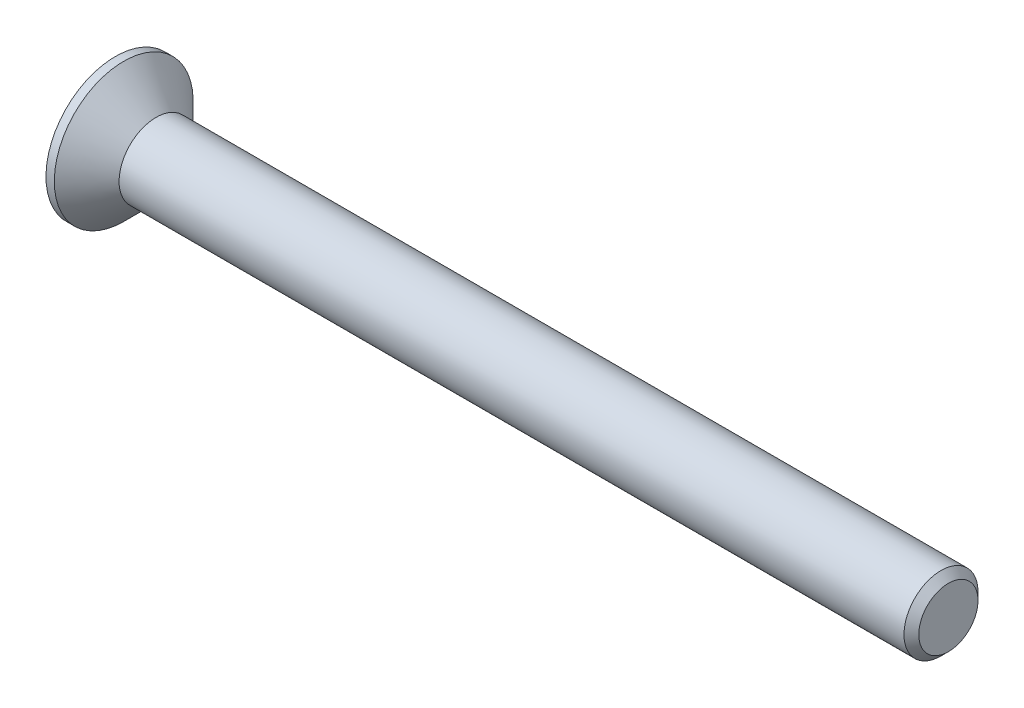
ISO-10303-21;
HEADER;
FILE_DESCRIPTION(('STEP AP214'),'2;1');
FILE_NAME('part.step','',(''),(''),'','','');
FILE_SCHEMA(('AUTOMOTIVE_DESIGN { 1 0 10303 214 1 1 1 1 }'));
ENDSEC;
DATA;
#1=APPLICATION_CONTEXT('core data for automotive mechanical design processes');
#2=APPLICATION_PROTOCOL_DEFINITION('international standard','automotive_design',2000,#1);
#3=PRODUCT_CONTEXT('',#1,'mechanical');
#4=PRODUCT('Part','Part','',(#3));
#5=PRODUCT_RELATED_PRODUCT_CATEGORY('part','',(#4));
#6=PRODUCT_DEFINITION_FORMATION('','',#4);
#7=PRODUCT_DEFINITION_CONTEXT('part definition',#1,'design');
#8=PRODUCT_DEFINITION('design','',#6,#7);
#9=PRODUCT_DEFINITION_SHAPE('','',#8);
#10=(LENGTH_UNIT() NAMED_UNIT(*) SI_UNIT(.MILLI.,.METRE.));
#11=(NAMED_UNIT(*) PLANE_ANGLE_UNIT() SI_UNIT($,.RADIAN.));
#12=(NAMED_UNIT(*) SI_UNIT($,.STERADIAN.) SOLID_ANGLE_UNIT());
#13=UNCERTAINTY_MEASURE_WITH_UNIT(LENGTH_MEASURE(1.E-05),#10,'distance_accuracy_value','');
#14=(GEOMETRIC_REPRESENTATION_CONTEXT(3) GLOBAL_UNCERTAINTY_ASSIGNED_CONTEXT((#13)) GLOBAL_UNIT_ASSIGNED_CONTEXT((#10,
#11,#12)) REPRESENTATION_CONTEXT('',''));
#15=CARTESIAN_POINT('',(0.,0.,0.));
#16=DIRECTION('',(0.,0.,1.));
#17=DIRECTION('',(1.,0.,0.));
#18=AXIS2_PLACEMENT_3D('',#15,#16,#17);
#19=CARTESIAN_POINT('',(0.,0.,0.));
#20=DIRECTION('',(-1.,0.,0.));
#21=DIRECTION('',(0.,-1.,0.));
#22=AXIS2_PLACEMENT_3D('',#19,#20,#21);
#23=CONICAL_SURFACE('',#22,2.,0.78539816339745);
#24=CARTESIAN_POINT('',(-1.74999999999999,0.,0.));
#25=DIRECTION('',(-1.,0.,0.));
#26=DIRECTION('',(0.,-1.,0.));
#27=AXIS2_PLACEMENT_3D('',#24,#25,#26);
#28=CIRCLE('',#27,3.75);
#29=CARTESIAN_POINT('',(-1.74999999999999,-3.75,0.));
#30=VERTEX_POINT('',#29);
#31=EDGE_CURVE('E189',#30,#30,#28,.T.);
#32=ORIENTED_EDGE('',*,*,#31,.F.);
#33=EDGE_LOOP('',(#32));
#34=FACE_BOUND('',#33,.T.);
#35=CARTESIAN_POINT('',(0.,0.,0.));
#36=DIRECTION('',(-1.,0.,0.));
#37=DIRECTION('',(0.,-1.,0.));
#38=AXIS2_PLACEMENT_3D('',#35,#36,#37);
#39=CIRCLE('',#38,2.);
#40=CARTESIAN_POINT('',(0.,-2.,0.));
#41=VERTEX_POINT('',#40);
#42=EDGE_CURVE('E212',#41,#41,#39,.T.);
#43=ORIENTED_EDGE('',*,*,#42,.T.);
#44=EDGE_LOOP('',(#43));
#45=FACE_BOUND('',#44,.T.);
#46=ADVANCED_FACE('F33',(#34,#45),#23,.T.);
#47=CARTESIAN_POINT('',(-2.2,0.,0.));
#48=DIRECTION('',(-1.,0.,0.));
#49=DIRECTION('',(0.,-1.,0.));
#50=AXIS2_PLACEMENT_3D('',#47,#48,#49);
#51=CYLINDRICAL_SURFACE('',#50,2.);
#52=CARTESIAN_POINT('',(42.4,0.,0.));
#53=DIRECTION('',(-1.,0.,0.));
#54=DIRECTION('',(0.,-1.,0.));
#55=AXIS2_PLACEMENT_3D('',#52,#53,#54);
#56=CIRCLE('',#55,2.);
#57=CARTESIAN_POINT('',(42.4,-2.,0.));
#58=VERTEX_POINT('',#57);
#59=EDGE_CURVE('E41',#58,#58,#56,.T.);
#60=ORIENTED_EDGE('',*,*,#59,.T.);
#61=EDGE_LOOP('',(#60));
#62=FACE_BOUND('',#61,.T.);
#63=ORIENTED_EDGE('',*,*,#42,.F.);
#64=EDGE_LOOP('',(#63));
#65=FACE_BOUND('',#64,.T.);
#66=ADVANCED_FACE('F217',(#62,#65),#51,.T.);
#67=CARTESIAN_POINT('',(42.8,0.,0.));
#68=DIRECTION('',(-1.,0.,0.));
#69=DIRECTION('',(0.,-1.,0.));
#70=AXIS2_PLACEMENT_3D('',#67,#68,#69);
#71=PLANE('',#70);
#72=CARTESIAN_POINT('',(42.8,0.,0.));
#73=DIRECTION('',(-1.,0.,0.));
#74=DIRECTION('',(0.,-1.,0.));
#75=AXIS2_PLACEMENT_3D('',#72,#73,#74);
#76=CIRCLE('',#75,1.59999999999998);
#77=CARTESIAN_POINT('',(42.8,-1.59999999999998,0.));
#78=VERTEX_POINT('',#77);
#79=EDGE_CURVE('E11',#78,#78,#76,.F.);
#80=ORIENTED_EDGE('',*,*,#79,.T.);
#81=EDGE_LOOP('',(#80));
#82=FACE_BOUND('',#81,.T.);
#83=ADVANCED_FACE('F239',(#82),#71,.F.);
#84=CARTESIAN_POINT('',(-2.2,3.75,0.));
#85=DIRECTION('',(1.,0.,0.));
#86=DIRECTION('',(0.,1.,0.));
#87=AXIS2_PLACEMENT_3D('',#84,#85,#86);
#88=PLANE('',#87);
#89=DIRECTION('',(0.,0.,-1.));
#90=VECTOR('',#89,1.);
#91=CARTESIAN_POINT('',(-2.2,0.55,-2.2));
#92=LINE('',#91,#90);
#93=CARTESIAN_POINT('',(-2.2,0.55,-0.55));
#94=VERTEX_POINT('',#93);
#95=CARTESIAN_POINT('',(-2.2,0.55,-2.2));
#96=VERTEX_POINT('',#95);
#97=EDGE_CURVE('E158',#94,#96,#92,.T.);
#98=ORIENTED_EDGE('',*,*,#97,.F.);
#99=DIRECTION('',(0.,-1.,0.));
#100=VECTOR('',#99,1.);
#101=CARTESIAN_POINT('',(-2.2,0.55,-0.55));
#102=LINE('',#101,#100);
#103=CARTESIAN_POINT('',(-2.2,2.2,-0.55));
#104=VERTEX_POINT('',#103);
#105=EDGE_CURVE('E48',#104,#94,#102,.T.);
#106=ORIENTED_EDGE('',*,*,#105,.F.);
#107=DIRECTION('',(0.,0.,-1.));
#108=VECTOR('',#107,1.);
#109=CARTESIAN_POINT('',(-2.2,2.2,-0.55));
#110=LINE('',#109,#108);
#111=CARTESIAN_POINT('',(-2.2,2.2,0.55));
#112=VERTEX_POINT('',#111);
#113=EDGE_CURVE('E185',#112,#104,#110,.T.);
#114=ORIENTED_EDGE('',*,*,#113,.F.);
#115=DIRECTION('',(0.,1.,0.));
#116=VECTOR('',#115,1.);
#117=CARTESIAN_POINT('',(-2.2,2.2,0.55));
#118=LINE('',#117,#116);
#119=CARTESIAN_POINT('',(-2.2,0.55,0.55));
#120=VERTEX_POINT('',#119);
#121=EDGE_CURVE('E183',#120,#112,#118,.T.);
#122=ORIENTED_EDGE('',*,*,#121,.F.);
#123=DIRECTION('',(0.,0.,-1.));
#124=VECTOR('',#123,1.);
#125=CARTESIAN_POINT('',(-2.2,0.55,0.55));
#126=LINE('',#125,#124);
#127=CARTESIAN_POINT('',(-2.2,0.55,2.2));
#128=VERTEX_POINT('',#127);
#129=EDGE_CURVE('E132',#128,#120,#126,.T.);
#130=ORIENTED_EDGE('',*,*,#129,.F.);
#131=DIRECTION('',(0.,1.,0.));
#132=VECTOR('',#131,1.);
#133=CARTESIAN_POINT('',(-2.2,0.55,2.2));
#134=LINE('',#133,#132);
#135=CARTESIAN_POINT('',(-2.2,-0.55,2.2));
#136=VERTEX_POINT('',#135);
#137=EDGE_CURVE('E179',#136,#128,#134,.T.);
#138=ORIENTED_EDGE('',*,*,#137,.F.);
#139=DIRECTION('',(0.,0.,1.));
#140=VECTOR('',#139,1.);
#141=CARTESIAN_POINT('',(-2.2,-0.55,2.2));
#142=LINE('',#141,#140);
#143=CARTESIAN_POINT('',(-2.2,-0.55,0.55));
#144=VERTEX_POINT('',#143);
#145=EDGE_CURVE('E176',#144,#136,#142,.T.);
#146=ORIENTED_EDGE('',*,*,#145,.F.);
#147=DIRECTION('',(0.,1.,0.));
#148=VECTOR('',#147,1.);
#149=CARTESIAN_POINT('',(-2.2,-0.55,0.55));
#150=LINE('',#149,#148);
#151=CARTESIAN_POINT('',(-2.2,-2.2,0.55));
#152=VERTEX_POINT('',#151);
#153=EDGE_CURVE('E173',#152,#144,#150,.T.);
#154=ORIENTED_EDGE('',*,*,#153,.F.);
#155=DIRECTION('',(0.,0.,1.));
#156=VECTOR('',#155,1.);
#157=CARTESIAN_POINT('',(-2.2,-2.2,0.55));
#158=LINE('',#157,#156);
#159=CARTESIAN_POINT('',(-2.2,-2.2,-0.55));
#160=VERTEX_POINT('',#159);
#161=EDGE_CURVE('E170',#160,#152,#158,.T.);
#162=ORIENTED_EDGE('',*,*,#161,.F.);
#163=DIRECTION('',(0.,-1.,0.));
#164=VECTOR('',#163,1.);
#165=CARTESIAN_POINT('',(-2.2,-2.2,-0.55));
#166=LINE('',#165,#164);
#167=CARTESIAN_POINT('',(-2.2,-0.55,-0.55));
#168=VERTEX_POINT('',#167);
#169=EDGE_CURVE('E167',#168,#160,#166,.T.);
#170=ORIENTED_EDGE('',*,*,#169,.F.);
#171=DIRECTION('',(0.,0.,1.));
#172=VECTOR('',#171,1.);
#173=CARTESIAN_POINT('',(-2.2,-0.55,-0.55));
#174=LINE('',#173,#172);
#175=CARTESIAN_POINT('',(-2.2,-0.55,-2.2));
#176=VERTEX_POINT('',#175);
#177=EDGE_CURVE('E164',#176,#168,#174,.T.);
#178=ORIENTED_EDGE('',*,*,#177,.F.);
#179=DIRECTION('',(0.,-1.,0.));
#180=VECTOR('',#179,1.);
#181=CARTESIAN_POINT('',(-2.2,-0.55,-2.2));
#182=LINE('',#181,#180);
#183=EDGE_CURVE('E161',#96,#176,#182,.T.);
#184=ORIENTED_EDGE('',*,*,#183,.F.);
#185=EDGE_LOOP('',(#98,#106,#114,#122,#130,#138,#146,#154,#162,#170,#178,#184));
#186=FACE_BOUND('',#185,.T.);
#187=CARTESIAN_POINT('',(-2.2,0.,0.));
#188=DIRECTION('',(-1.,0.,0.));
#189=DIRECTION('',(0.,-1.,0.));
#190=AXIS2_PLACEMENT_3D('',#187,#188,#189);
#191=CIRCLE('',#190,3.75);
#192=CARTESIAN_POINT('',(-2.2,-3.75,0.));
#193=VERTEX_POINT('',#192);
#194=EDGE_CURVE('E209',#193,#193,#191,.T.);
#195=ORIENTED_EDGE('',*,*,#194,.T.);
#196=EDGE_LOOP('',(#195));
#197=FACE_BOUND('',#196,.T.);
#198=ADVANCED_FACE('F230',(#186,#197),#88,.F.);
#199=CARTESIAN_POINT('',(-2.2,0.,0.));
#200=DIRECTION('',(-1.,0.,0.));
#201=DIRECTION('',(0.,-1.,0.));
#202=AXIS2_PLACEMENT_3D('',#199,#200,#201);
#203=CYLINDRICAL_SURFACE('',#202,3.75);
#204=ORIENTED_EDGE('',*,*,#194,.F.);
#205=EDGE_LOOP('',(#204));
#206=FACE_BOUND('',#205,.T.);
#207=ORIENTED_EDGE('',*,*,#31,.T.);
#208=EDGE_LOOP('',(#207));
#209=FACE_BOUND('',#208,.T.);
#210=ADVANCED_FACE('F222',(#206,#209),#203,.T.);
#211=CARTESIAN_POINT('',(42.4,0.,0.));
#212=DIRECTION('',(-1.,0.,0.));
#213=DIRECTION('',(0.,-1.,0.));
#214=AXIS2_PLACEMENT_3D('',#211,#212,#213);
#215=CONICAL_SURFACE('',#214,2.,0.785398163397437);
#216=ORIENTED_EDGE('',*,*,#79,.F.);
#217=EDGE_LOOP('',(#216));
#218=FACE_BOUND('',#217,.T.);
#219=ORIENTED_EDGE('',*,*,#59,.F.);
#220=EDGE_LOOP('',(#219));
#221=FACE_BOUND('',#220,.T.);
#222=ADVANCED_FACE('F35',(#218,#221),#215,.T.);
#223=CARTESIAN_POINT('',(-0.3,0.55,-0.55));
#224=DIRECTION('',(0.,0.,-1.));
#225=DIRECTION('',(-1.,0.,0.));
#226=AXIS2_PLACEMENT_3D('',#223,#224,#225);
#227=PLANE('',#226);
#228=ORIENTED_EDGE('',*,*,#105,.T.);
#229=DIRECTION('',(-1.,0.,0.));
#230=VECTOR('',#229,1.);
#231=CARTESIAN_POINT('',(-0.3,0.55,-0.55));
#232=LINE('',#231,#230);
#233=CARTESIAN_POINT('',(-0.3,0.55,-0.55));
#234=VERTEX_POINT('',#233);
#235=EDGE_CURVE('E96',#234,#94,#232,.T.);
#236=ORIENTED_EDGE('',*,*,#235,.F.);
#237=DIRECTION('',(0.,-1.,0.));
#238=VECTOR('',#237,1.);
#239=CARTESIAN_POINT('',(-0.3,0.55,-0.55));
#240=LINE('',#239,#238);
#241=CARTESIAN_POINT('',(-0.3,2.2,-0.55));
#242=VERTEX_POINT('',#241);
#243=EDGE_CURVE('E187',#242,#234,#240,.T.);
#244=ORIENTED_EDGE('',*,*,#243,.F.);
#245=DIRECTION('',(-1.,0.,0.));
#246=VECTOR('',#245,1.);
#247=CARTESIAN_POINT('',(-0.3,2.2,-0.55));
#248=LINE('',#247,#246);
#249=EDGE_CURVE('E56',#242,#104,#248,.T.);
#250=ORIENTED_EDGE('',*,*,#249,.T.);
#251=EDGE_LOOP('',(#228,#236,#244,#250));
#252=FACE_BOUND('',#251,.T.);
#253=ADVANCED_FACE('F221',(#252),#227,.F.);
#254=CARTESIAN_POINT('',(-0.3,2.2,-0.55));
#255=DIRECTION('',(0.,1.,0.));
#256=DIRECTION('',(-1.,0.,0.));
#257=AXIS2_PLACEMENT_3D('',#254,#255,#256);
#258=PLANE('',#257);
#259=ORIENTED_EDGE('',*,*,#113,.T.);
#260=ORIENTED_EDGE('',*,*,#249,.F.);
#261=DIRECTION('',(0.,0.,-1.));
#262=VECTOR('',#261,1.);
#263=CARTESIAN_POINT('',(-0.3,2.2,-0.55));
#264=LINE('',#263,#262);
#265=CARTESIAN_POINT('',(-0.3,2.2,0.55));
#266=VERTEX_POINT('',#265);
#267=EDGE_CURVE('E144',#266,#242,#264,.T.);
#268=ORIENTED_EDGE('',*,*,#267,.F.);
#269=DIRECTION('',(-1.,0.,0.));
#270=VECTOR('',#269,1.);
#271=CARTESIAN_POINT('',(-0.3,2.2,0.55));
#272=LINE('',#271,#270);
#273=EDGE_CURVE('E136',#266,#112,#272,.T.);
#274=ORIENTED_EDGE('',*,*,#273,.T.);
#275=EDGE_LOOP('',(#259,#260,#268,#274));
#276=FACE_BOUND('',#275,.T.);
#277=ADVANCED_FACE('F228',(#276),#258,.F.);
#278=CARTESIAN_POINT('',(-0.3,2.2,0.55));
#279=DIRECTION('',(0.,0.,1.));
#280=DIRECTION('',(1.,0.,0.));
#281=AXIS2_PLACEMENT_3D('',#278,#279,#280);
#282=PLANE('',#281);
#283=ORIENTED_EDGE('',*,*,#121,.T.);
#284=ORIENTED_EDGE('',*,*,#273,.F.);
#285=DIRECTION('',(0.,1.,0.));
#286=VECTOR('',#285,1.);
#287=CARTESIAN_POINT('',(-0.3,2.2,0.55));
#288=LINE('',#287,#286);
#289=CARTESIAN_POINT('',(-0.3,0.55,0.55));
#290=VERTEX_POINT('',#289);
#291=EDGE_CURVE('E140',#290,#266,#288,.T.);
#292=ORIENTED_EDGE('',*,*,#291,.F.);
#293=DIRECTION('',(-1.,0.,0.));
#294=VECTOR('',#293,1.);
#295=CARTESIAN_POINT('',(-0.3,0.55,0.55));
#296=LINE('',#295,#294);
#297=EDGE_CURVE('E125',#290,#120,#296,.T.);
#298=ORIENTED_EDGE('',*,*,#297,.T.);
#299=EDGE_LOOP('',(#283,#284,#292,#298));
#300=FACE_BOUND('',#299,.T.);
#301=ADVANCED_FACE('F141',(#300),#282,.F.);
#302=CARTESIAN_POINT('',(-0.3,0.55,0.55));
#303=DIRECTION('',(0.,1.,0.));
#304=DIRECTION('',(-1.,0.,0.));
#305=AXIS2_PLACEMENT_3D('',#302,#303,#304);
#306=PLANE('',#305);
#307=ORIENTED_EDGE('',*,*,#129,.T.);
#308=ORIENTED_EDGE('',*,*,#297,.F.);
#309=DIRECTION('',(0.,0.,-1.));
#310=VECTOR('',#309,1.);
#311=CARTESIAN_POINT('',(-0.3,0.55,0.55));
#312=LINE('',#311,#310);
#313=CARTESIAN_POINT('',(-0.3,0.55,2.2));
#314=VERTEX_POINT('',#313);
#315=EDGE_CURVE('E129',#314,#290,#312,.T.);
#316=ORIENTED_EDGE('',*,*,#315,.F.);
#317=DIRECTION('',(-1.,0.,0.));
#318=VECTOR('',#317,1.);
#319=CARTESIAN_POINT('',(-0.3,0.55,2.2));
#320=LINE('',#319,#318);
#321=EDGE_CURVE('E137',#314,#128,#320,.T.);
#322=ORIENTED_EDGE('',*,*,#321,.T.);
#323=EDGE_LOOP('',(#307,#308,#316,#322));
#324=FACE_BOUND('',#323,.T.);
#325=ADVANCED_FACE('F127',(#324),#306,.F.);
#326=CARTESIAN_POINT('',(-0.3,0.55,2.2));
#327=DIRECTION('',(0.,0.,1.));
#328=DIRECTION('',(1.,0.,0.));
#329=AXIS2_PLACEMENT_3D('',#326,#327,#328);
#330=PLANE('',#329);
#331=ORIENTED_EDGE('',*,*,#137,.T.);
#332=ORIENTED_EDGE('',*,*,#321,.F.);
#333=DIRECTION('',(0.,1.,0.));
#334=VECTOR('',#333,1.);
#335=CARTESIAN_POINT('',(-0.3,0.55,2.2));
#336=LINE('',#335,#334);
#337=CARTESIAN_POINT('',(-0.3,-0.55,2.2));
#338=VERTEX_POINT('',#337);
#339=EDGE_CURVE('E150',#338,#314,#336,.T.);
#340=ORIENTED_EDGE('',*,*,#339,.F.);
#341=DIRECTION('',(-1.,0.,0.));
#342=VECTOR('',#341,1.);
#343=CARTESIAN_POINT('',(-0.3,-0.55,2.2));
#344=LINE('',#343,#342);
#345=EDGE_CURVE('E192',#338,#136,#344,.T.);
#346=ORIENTED_EDGE('',*,*,#345,.T.);
#347=EDGE_LOOP('',(#331,#332,#340,#346));
#348=FACE_BOUND('',#347,.T.);
#349=ADVANCED_FACE('F277',(#348),#330,.F.);
#350=CARTESIAN_POINT('',(-0.3,-0.55,2.2));
#351=DIRECTION('',(0.,-1.,0.));
#352=DIRECTION('',(1.,0.,0.));
#353=AXIS2_PLACEMENT_3D('',#350,#351,#352);
#354=PLANE('',#353);
#355=ORIENTED_EDGE('',*,*,#145,.T.);
#356=ORIENTED_EDGE('',*,*,#345,.F.);
#357=DIRECTION('',(0.,0.,1.));
#358=VECTOR('',#357,1.);
#359=CARTESIAN_POINT('',(-0.3,-0.55,2.2));
#360=LINE('',#359,#358);
#361=CARTESIAN_POINT('',(-0.3,-0.55,0.55));
#362=VERTEX_POINT('',#361);
#363=EDGE_CURVE('E152',#362,#338,#360,.T.);
#364=ORIENTED_EDGE('',*,*,#363,.F.);
#365=DIRECTION('',(-1.,0.,0.));
#366=VECTOR('',#365,1.);
#367=CARTESIAN_POINT('',(-0.3,-0.55,0.55));
#368=LINE('',#367,#366);
#369=EDGE_CURVE('E194',#362,#144,#368,.T.);
#370=ORIENTED_EDGE('',*,*,#369,.T.);
#371=EDGE_LOOP('',(#355,#356,#364,#370));
#372=FACE_BOUND('',#371,.T.);
#373=ADVANCED_FACE('F273',(#372),#354,.F.);
#374=CARTESIAN_POINT('',(-0.3,-0.55,0.55));
#375=DIRECTION('',(0.,0.,1.));
#376=DIRECTION('',(1.,0.,0.));
#377=AXIS2_PLACEMENT_3D('',#374,#375,#376);
#378=PLANE('',#377);
#379=ORIENTED_EDGE('',*,*,#153,.T.);
#380=ORIENTED_EDGE('',*,*,#369,.F.);
#381=DIRECTION('',(0.,1.,0.));
#382=VECTOR('',#381,1.);
#383=CARTESIAN_POINT('',(-0.3,-0.55,0.55));
#384=LINE('',#383,#382);
#385=CARTESIAN_POINT('',(-0.3,-2.2,0.55));
#386=VERTEX_POINT('',#385);
#387=EDGE_CURVE('E422',#386,#362,#384,.T.);
#388=ORIENTED_EDGE('',*,*,#387,.F.);
#389=DIRECTION('',(-1.,0.,0.));
#390=VECTOR('',#389,1.);
#391=CARTESIAN_POINT('',(-0.3,-2.2,0.55));
#392=LINE('',#391,#390);
#393=EDGE_CURVE('E196',#386,#152,#392,.T.);
#394=ORIENTED_EDGE('',*,*,#393,.T.);
#395=EDGE_LOOP('',(#379,#380,#388,#394));
#396=FACE_BOUND('',#395,.T.);
#397=ADVANCED_FACE('F269',(#396),#378,.F.);
#398=CARTESIAN_POINT('',(-0.3,-2.2,0.55));
#399=DIRECTION('',(0.,-1.,0.));
#400=DIRECTION('',(1.,0.,0.));
#401=AXIS2_PLACEMENT_3D('',#398,#399,#400);
#402=PLANE('',#401);
#403=ORIENTED_EDGE('',*,*,#161,.T.);
#404=ORIENTED_EDGE('',*,*,#393,.F.);
#405=DIRECTION('',(0.,0.,1.));
#406=VECTOR('',#405,1.);
#407=CARTESIAN_POINT('',(-0.3,-2.2,0.55));
#408=LINE('',#407,#406);
#409=CARTESIAN_POINT('',(-0.3,-2.2,-0.55));
#410=VERTEX_POINT('',#409);
#411=EDGE_CURVE('E419',#410,#386,#408,.T.);
#412=ORIENTED_EDGE('',*,*,#411,.F.);
#413=DIRECTION('',(-1.,0.,0.));
#414=VECTOR('',#413,1.);
#415=CARTESIAN_POINT('',(-0.3,-2.2,-0.55));
#416=LINE('',#415,#414);
#417=EDGE_CURVE('E198',#410,#160,#416,.T.);
#418=ORIENTED_EDGE('',*,*,#417,.T.);
#419=EDGE_LOOP('',(#403,#404,#412,#418));
#420=FACE_BOUND('',#419,.T.);
#421=ADVANCED_FACE('F265',(#420),#402,.F.);
#422=CARTESIAN_POINT('',(-0.3,-2.2,-0.55));
#423=DIRECTION('',(0.,0.,-1.));
#424=DIRECTION('',(-1.,0.,0.));
#425=AXIS2_PLACEMENT_3D('',#422,#423,#424);
#426=PLANE('',#425);
#427=ORIENTED_EDGE('',*,*,#169,.T.);
#428=ORIENTED_EDGE('',*,*,#417,.F.);
#429=DIRECTION('',(0.,-1.,0.));
#430=VECTOR('',#429,1.);
#431=CARTESIAN_POINT('',(-0.3,-2.2,-0.55));
#432=LINE('',#431,#430);
#433=CARTESIAN_POINT('',(-0.3,-0.55,-0.55));
#434=VERTEX_POINT('',#433);
#435=EDGE_CURVE('E416',#434,#410,#432,.T.);
#436=ORIENTED_EDGE('',*,*,#435,.F.);
#437=DIRECTION('',(-1.,0.,0.));
#438=VECTOR('',#437,1.);
#439=CARTESIAN_POINT('',(-0.3,-0.55,-0.55));
#440=LINE('',#439,#438);
#441=EDGE_CURVE('E200',#434,#168,#440,.T.);
#442=ORIENTED_EDGE('',*,*,#441,.T.);
#443=EDGE_LOOP('',(#427,#428,#436,#442));
#444=FACE_BOUND('',#443,.T.);
#445=ADVANCED_FACE('F261',(#444),#426,.F.);
#446=CARTESIAN_POINT('',(-0.3,-0.55,-0.55));
#447=DIRECTION('',(0.,-1.,0.));
#448=DIRECTION('',(1.,0.,0.));
#449=AXIS2_PLACEMENT_3D('',#446,#447,#448);
#450=PLANE('',#449);
#451=ORIENTED_EDGE('',*,*,#177,.T.);
#452=ORIENTED_EDGE('',*,*,#441,.F.);
#453=DIRECTION('',(0.,0.,1.));
#454=VECTOR('',#453,1.);
#455=CARTESIAN_POINT('',(-0.3,-0.55,-0.55));
#456=LINE('',#455,#454);
#457=CARTESIAN_POINT('',(-0.3,-0.55,-2.2));
#458=VERTEX_POINT('',#457);
#459=EDGE_CURVE('E413',#458,#434,#456,.T.);
#460=ORIENTED_EDGE('',*,*,#459,.F.);
#461=DIRECTION('',(-1.,0.,0.));
#462=VECTOR('',#461,1.);
#463=CARTESIAN_POINT('',(-0.3,-0.55,-2.2));
#464=LINE('',#463,#462);
#465=EDGE_CURVE('E202',#458,#176,#464,.T.);
#466=ORIENTED_EDGE('',*,*,#465,.T.);
#467=EDGE_LOOP('',(#451,#452,#460,#466));
#468=FACE_BOUND('',#467,.T.);
#469=ADVANCED_FACE('F257',(#468),#450,.F.);
#470=CARTESIAN_POINT('',(-0.3,-0.55,-2.2));
#471=DIRECTION('',(0.,0.,-1.));
#472=DIRECTION('',(-1.,0.,0.));
#473=AXIS2_PLACEMENT_3D('',#470,#471,#472);
#474=PLANE('',#473);
#475=ORIENTED_EDGE('',*,*,#183,.T.);
#476=ORIENTED_EDGE('',*,*,#465,.F.);
#477=DIRECTION('',(0.,-1.,0.));
#478=VECTOR('',#477,1.);
#479=CARTESIAN_POINT('',(-0.3,-0.55,-2.2));
#480=LINE('',#479,#478);
#481=CARTESIAN_POINT('',(-0.3,0.55,-2.2));
#482=VERTEX_POINT('',#481);
#483=EDGE_CURVE('E408',#482,#458,#480,.T.);
#484=ORIENTED_EDGE('',*,*,#483,.F.);
#485=DIRECTION('',(-1.,0.,0.));
#486=VECTOR('',#485,1.);
#487=CARTESIAN_POINT('',(-0.3,0.55,-2.2));
#488=LINE('',#487,#486);
#489=EDGE_CURVE('E204',#482,#96,#488,.T.);
#490=ORIENTED_EDGE('',*,*,#489,.T.);
#491=EDGE_LOOP('',(#475,#476,#484,#490));
#492=FACE_BOUND('',#491,.T.);
#493=ADVANCED_FACE('F253',(#492),#474,.F.);
#494=CARTESIAN_POINT('',(-0.3,0.55,-2.2));
#495=DIRECTION('',(0.,1.,0.));
#496=DIRECTION('',(-1.,0.,0.));
#497=AXIS2_PLACEMENT_3D('',#494,#495,#496);
#498=PLANE('',#497);
#499=ORIENTED_EDGE('',*,*,#97,.T.);
#500=ORIENTED_EDGE('',*,*,#489,.F.);
#501=DIRECTION('',(0.,0.,-1.));
#502=VECTOR('',#501,1.);
#503=CARTESIAN_POINT('',(-0.3,0.55,-2.2));
#504=LINE('',#503,#502);
#505=EDGE_CURVE('E406',#234,#482,#504,.T.);
#506=ORIENTED_EDGE('',*,*,#505,.F.);
#507=ORIENTED_EDGE('',*,*,#235,.T.);
#508=EDGE_LOOP('',(#499,#500,#506,#507));
#509=FACE_BOUND('',#508,.T.);
#510=ADVANCED_FACE('F250',(#509),#498,.F.);
#511=CARTESIAN_POINT('',(-0.3,0.,0.));
#512=DIRECTION('',(1.,0.,0.));
#513=DIRECTION('',(0.,0.,-1.));
#514=AXIS2_PLACEMENT_3D('',#511,#512,#513);
#515=PLANE('',#514);
#516=ORIENTED_EDGE('',*,*,#243,.T.);
#517=ORIENTED_EDGE('',*,*,#505,.T.);
#518=ORIENTED_EDGE('',*,*,#483,.T.);
#519=ORIENTED_EDGE('',*,*,#459,.T.);
#520=ORIENTED_EDGE('',*,*,#435,.T.);
#521=ORIENTED_EDGE('',*,*,#411,.T.);
#522=ORIENTED_EDGE('',*,*,#387,.T.);
#523=ORIENTED_EDGE('',*,*,#363,.T.);
#524=ORIENTED_EDGE('',*,*,#339,.T.);
#525=ORIENTED_EDGE('',*,*,#315,.T.);
#526=ORIENTED_EDGE('',*,*,#291,.T.);
#527=ORIENTED_EDGE('',*,*,#267,.T.);
#528=EDGE_LOOP('',(#516,#517,#518,#519,#520,#521,#522,#523,#524,#525,#526,#527));
#529=FACE_BOUND('',#528,.T.);
#530=ADVANCED_FACE('F147',(#529),#515,.F.);
#531=CLOSED_SHELL('',(#46,#66,#83,#198,#210,#222,#253,#277,#301,#325,#349,#373,#397,#421,#445,
#469,#493,#510,#530));
#532=MANIFOLD_SOLID_BREP('B2',#531);
#533=ADVANCED_BREP_SHAPE_REPRESENTATION('',(#18,#532),#14);
#534=SHAPE_DEFINITION_REPRESENTATION(#9,#533);
ENDSEC;
END-ISO-10303-21;
